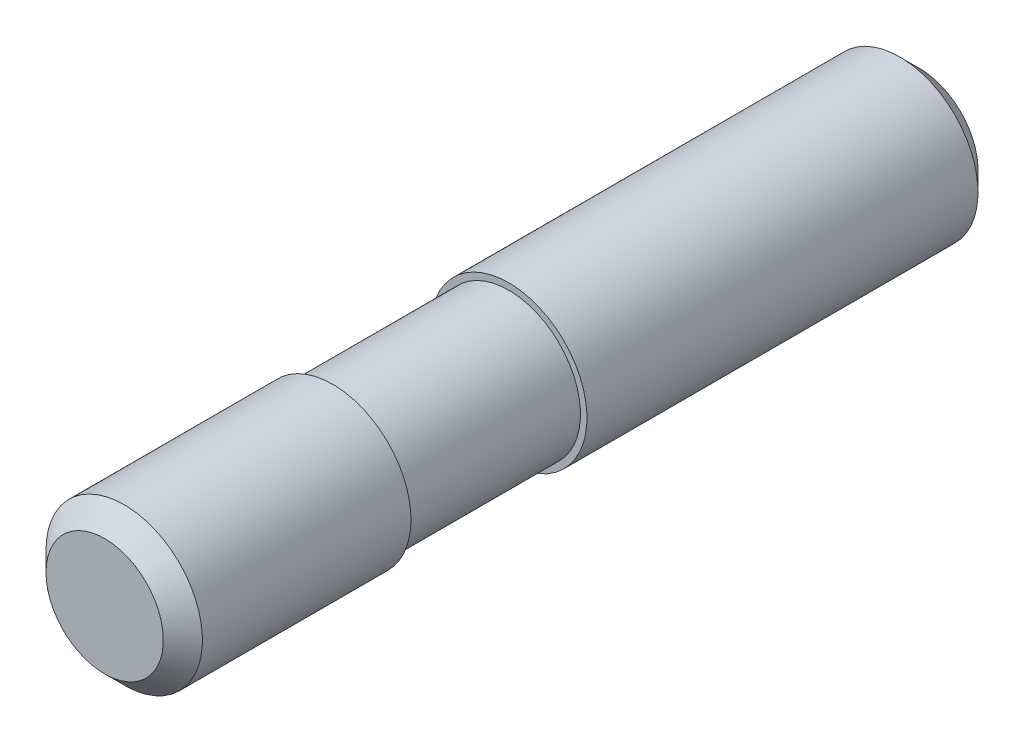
ISO-10303-21;
HEADER;
FILE_DESCRIPTION(('STEP AP214'),'2;1');
FILE_NAME('part.step','',(''),(''),'','','');
FILE_SCHEMA(('AUTOMOTIVE_DESIGN { 1 0 10303 214 1 1 1 1 }'));
ENDSEC;
DATA;
#1=APPLICATION_CONTEXT('core data for automotive mechanical design processes');
#2=APPLICATION_PROTOCOL_DEFINITION('international standard','automotive_design',2000,#1);
#3=PRODUCT_CONTEXT('',#1,'mechanical');
#4=PRODUCT('Part','Part','',(#3));
#5=PRODUCT_RELATED_PRODUCT_CATEGORY('part','',(#4));
#6=PRODUCT_DEFINITION_FORMATION('','',#4);
#7=PRODUCT_DEFINITION_CONTEXT('part definition',#1,'design');
#8=PRODUCT_DEFINITION('design','',#6,#7);
#9=PRODUCT_DEFINITION_SHAPE('','',#8);
#10=(LENGTH_UNIT() NAMED_UNIT(*) SI_UNIT(.MILLI.,.METRE.));
#11=(NAMED_UNIT(*) PLANE_ANGLE_UNIT() SI_UNIT($,.RADIAN.));
#12=(NAMED_UNIT(*) SI_UNIT($,.STERADIAN.) SOLID_ANGLE_UNIT());
#13=UNCERTAINTY_MEASURE_WITH_UNIT(LENGTH_MEASURE(1.E-05),#10,'distance_accuracy_value','');
#14=(GEOMETRIC_REPRESENTATION_CONTEXT(3) GLOBAL_UNCERTAINTY_ASSIGNED_CONTEXT((#13)) GLOBAL_UNIT_ASSIGNED_CONTEXT((#10,
#11,#12)) REPRESENTATION_CONTEXT('',''));
#15=CARTESIAN_POINT('',(0.,0.,0.));
#16=DIRECTION('',(0.,0.,1.));
#17=DIRECTION('',(1.,0.,0.));
#18=AXIS2_PLACEMENT_3D('',#15,#16,#17);
#19=CARTESIAN_POINT('',(-9.,0.,0.));
#20=DIRECTION('',(0.,0.,-1.));
#21=DIRECTION('',(-1.,0.,0.));
#22=AXIS2_PLACEMENT_3D('',#19,#20,#21);
#23=PLANE('',#22);
#24=CARTESIAN_POINT('',(0.,0.,0.));
#25=DIRECTION('',(0.,0.,-1.));
#26=DIRECTION('',(-1.,0.,0.));
#27=AXIS2_PLACEMENT_3D('',#24,#25,#26);
#28=CIRCLE('',#27,9.);
#29=CARTESIAN_POINT('',(-9.,0.,0.));
#30=VERTEX_POINT('',#29);
#31=EDGE_CURVE('E8',#30,#30,#28,.T.);
#32=ORIENTED_EDGE('',*,*,#31,.T.);
#33=EDGE_LOOP('',(#32));
#34=FACE_BOUND('',#33,.T.);
#35=ADVANCED_FACE('F12',(#34),#23,.T.);
#36=CARTESIAN_POINT('',(0.,0.,0.));
#37=DIRECTION('',(0.,0.,1.));
#38=DIRECTION('',(1.,0.,0.));
#39=AXIS2_PLACEMENT_3D('',#36,#37,#38);
#40=CONICAL_SURFACE('',#39,9.,0.785398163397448);
#41=CARTESIAN_POINT('',(0.,0.,3.));
#42=DIRECTION('',(0.,0.,-1.));
#43=DIRECTION('',(-1.,0.,0.));
#44=AXIS2_PLACEMENT_3D('',#41,#42,#43);
#45=CIRCLE('',#44,12.);
#46=CARTESIAN_POINT('',(-12.,0.,3.));
#47=VERTEX_POINT('',#46);
#48=EDGE_CURVE('E18',#47,#47,#45,.T.);
#49=ORIENTED_EDGE('',*,*,#48,.T.);
#50=EDGE_LOOP('',(#49));
#51=FACE_BOUND('',#50,.T.);
#52=ORIENTED_EDGE('',*,*,#31,.F.);
#53=EDGE_LOOP('',(#52));
#54=FACE_BOUND('',#53,.T.);
#55=ADVANCED_FACE('F57',(#51,#54),#40,.T.);
#56=CARTESIAN_POINT('',(0.,0.,0.));
#57=DIRECTION('',(0.,0.,-1.));
#58=DIRECTION('',(-1.,0.,0.));
#59=AXIS2_PLACEMENT_3D('',#56,#57,#58);
#60=CYLINDRICAL_SURFACE('',#59,12.);
#61=CARTESIAN_POINT('',(0.,0.,63.));
#62=DIRECTION('',(0.,0.,-1.));
#63=DIRECTION('',(-1.,0.,0.));
#64=AXIS2_PLACEMENT_3D('',#61,#62,#63);
#65=CIRCLE('',#64,12.);
#66=CARTESIAN_POINT('',(-12.,0.,63.));
#67=VERTEX_POINT('',#66);
#68=EDGE_CURVE('E22',#67,#67,#65,.T.);
#69=ORIENTED_EDGE('',*,*,#68,.T.);
#70=EDGE_LOOP('',(#69));
#71=FACE_BOUND('',#70,.T.);
#72=ORIENTED_EDGE('',*,*,#48,.F.);
#73=EDGE_LOOP('',(#72));
#74=FACE_BOUND('',#73,.T.);
#75=ADVANCED_FACE('F61',(#71,#74),#60,.T.);
#76=CARTESIAN_POINT('',(-11.,0.,63.));
#77=DIRECTION('',(0.,0.,1.));
#78=DIRECTION('',(1.,0.,0.));
#79=AXIS2_PLACEMENT_3D('',#76,#77,#78);
#80=PLANE('',#79);
#81=CARTESIAN_POINT('',(0.,0.,63.));
#82=DIRECTION('',(0.,0.,-1.));
#83=DIRECTION('',(-1.,0.,0.));
#84=AXIS2_PLACEMENT_3D('',#81,#82,#83);
#85=CIRCLE('',#84,11.);
#86=CARTESIAN_POINT('',(-11.,0.,63.));
#87=VERTEX_POINT('',#86);
#88=EDGE_CURVE('E26',#87,#87,#85,.T.);
#89=ORIENTED_EDGE('',*,*,#88,.T.);
#90=EDGE_LOOP('',(#89));
#91=FACE_BOUND('',#90,.T.);
#92=ORIENTED_EDGE('',*,*,#68,.F.);
#93=EDGE_LOOP('',(#92));
#94=FACE_BOUND('',#93,.T.);
#95=ADVANCED_FACE('F65',(#91,#94),#80,.T.);
#96=CARTESIAN_POINT('',(0.,0.,0.));
#97=DIRECTION('',(0.,0.,-1.));
#98=DIRECTION('',(-1.,0.,0.));
#99=AXIS2_PLACEMENT_3D('',#96,#97,#98);
#100=CYLINDRICAL_SURFACE('',#99,11.);
#101=CARTESIAN_POINT('',(0.,0.,90.));
#102=DIRECTION('',(0.,0.,-1.));
#103=DIRECTION('',(-1.,0.,0.));
#104=AXIS2_PLACEMENT_3D('',#101,#102,#103);
#105=CIRCLE('',#104,11.);
#106=CARTESIAN_POINT('',(-11.,0.,90.));
#107=VERTEX_POINT('',#106);
#108=EDGE_CURVE('E31',#107,#107,#105,.T.);
#109=ORIENTED_EDGE('',*,*,#108,.T.);
#110=EDGE_LOOP('',(#109));
#111=FACE_BOUND('',#110,.T.);
#112=ORIENTED_EDGE('',*,*,#88,.F.);
#113=EDGE_LOOP('',(#112));
#114=FACE_BOUND('',#113,.T.);
#115=ADVANCED_FACE('F72',(#111,#114),#100,.T.);
#116=CARTESIAN_POINT('',(-12.,0.,90.));
#117=DIRECTION('',(0.,0.,-1.));
#118=DIRECTION('',(-1.,0.,0.));
#119=AXIS2_PLACEMENT_3D('',#116,#117,#118);
#120=PLANE('',#119);
#121=CARTESIAN_POINT('',(0.,0.,90.));
#122=DIRECTION('',(0.,0.,-1.));
#123=DIRECTION('',(-1.,0.,0.));
#124=AXIS2_PLACEMENT_3D('',#121,#122,#123);
#125=CIRCLE('',#124,12.);
#126=CARTESIAN_POINT('',(-12.,0.,90.));
#127=VERTEX_POINT('',#126);
#128=EDGE_CURVE('E34',#127,#127,#125,.T.);
#129=ORIENTED_EDGE('',*,*,#128,.T.);
#130=EDGE_LOOP('',(#129));
#131=FACE_BOUND('',#130,.T.);
#132=ORIENTED_EDGE('',*,*,#108,.F.);
#133=EDGE_LOOP('',(#132));
#134=FACE_BOUND('',#133,.T.);
#135=ADVANCED_FACE('F76',(#131,#134),#120,.T.);
#136=CARTESIAN_POINT('',(0.,0.,0.));
#137=DIRECTION('',(0.,0.,-1.));
#138=DIRECTION('',(-1.,0.,0.));
#139=AXIS2_PLACEMENT_3D('',#136,#137,#138);
#140=CYLINDRICAL_SURFACE('',#139,12.);
#141=CARTESIAN_POINT('',(0.,0.,122.));
#142=DIRECTION('',(0.,0.,-1.));
#143=DIRECTION('',(-1.,0.,0.));
#144=AXIS2_PLACEMENT_3D('',#141,#142,#143);
#145=CIRCLE('',#144,12.);
#146=CARTESIAN_POINT('',(-12.,0.,122.));
#147=VERTEX_POINT('',#146);
#148=EDGE_CURVE('E37',#147,#147,#145,.T.);
#149=ORIENTED_EDGE('',*,*,#148,.T.);
#150=EDGE_LOOP('',(#149));
#151=FACE_BOUND('',#150,.T.);
#152=ORIENTED_EDGE('',*,*,#128,.F.);
#153=EDGE_LOOP('',(#152));
#154=FACE_BOUND('',#153,.T.);
#155=ADVANCED_FACE('F54',(#151,#154),#140,.T.);
#156=CARTESIAN_POINT('',(0.,0.,122.));
#157=DIRECTION('',(0.,0.,-1.));
#158=DIRECTION('',(-1.,0.,0.));
#159=AXIS2_PLACEMENT_3D('',#156,#157,#158);
#160=CONICAL_SURFACE('',#159,12.,0.785398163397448);
#161=CARTESIAN_POINT('',(0.,0.,125.));
#162=DIRECTION('',(0.,0.,-1.));
#163=DIRECTION('',(-1.,0.,0.));
#164=AXIS2_PLACEMENT_3D('',#161,#162,#163);
#165=CIRCLE('',#164,9.);
#166=CARTESIAN_POINT('',(-9.,0.,125.));
#167=VERTEX_POINT('',#166);
#168=EDGE_CURVE('E40',#167,#167,#165,.T.);
#169=ORIENTED_EDGE('',*,*,#168,.T.);
#170=EDGE_LOOP('',(#169));
#171=FACE_BOUND('',#170,.T.);
#172=ORIENTED_EDGE('',*,*,#148,.F.);
#173=EDGE_LOOP('',(#172));
#174=FACE_BOUND('',#173,.T.);
#175=ADVANCED_FACE('F44',(#171,#174),#160,.T.);
#176=CARTESIAN_POINT('',(0.,0.,125.));
#177=DIRECTION('',(0.,0.,1.));
#178=DIRECTION('',(1.,0.,0.));
#179=AXIS2_PLACEMENT_3D('',#176,#177,#178);
#180=PLANE('',#179);
#181=ORIENTED_EDGE('',*,*,#168,.F.);
#182=EDGE_LOOP('',(#181));
#183=FACE_BOUND('',#182,.T.);
#184=ADVANCED_FACE('F47',(#183),#180,.T.);
#185=CLOSED_SHELL('',(#35,#55,#75,#95,#115,#135,#155,#175,#184));
#186=MANIFOLD_SOLID_BREP('B1',#185);
#187=ADVANCED_BREP_SHAPE_REPRESENTATION('',(#18,#186),#14);
#188=SHAPE_DEFINITION_REPRESENTATION(#9,#187);
ENDSEC;
END-ISO-10303-21;
